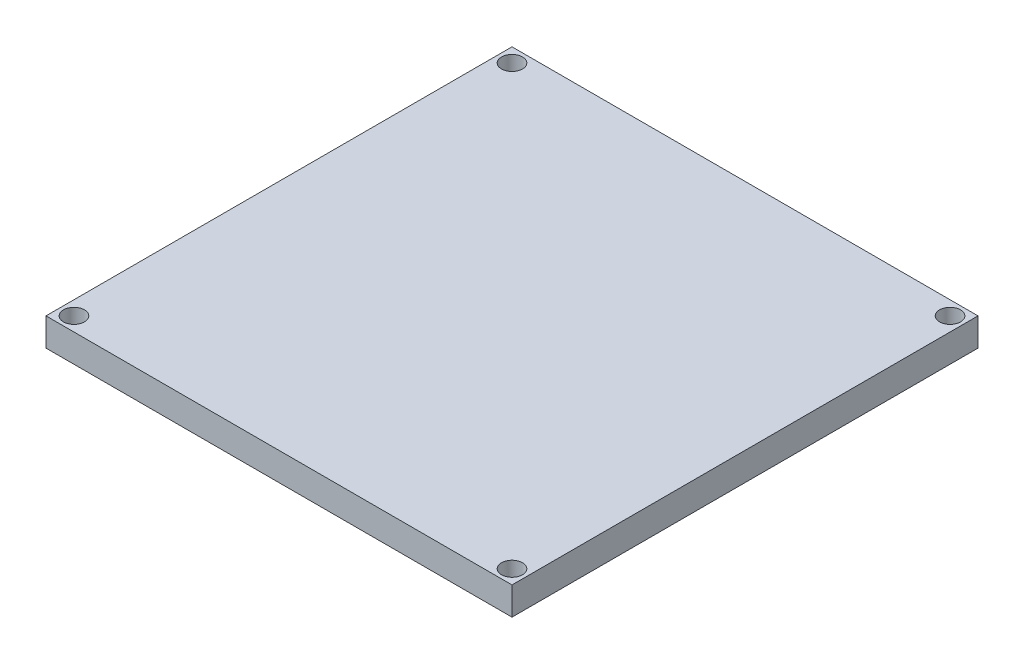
from build123d import *

# Parameters (mm, degrees)
SKETCH1_W           = 100
SKETCH1_H           = 100
BOSS_EXTRUDE1_DEPTH = 6
SKETCH2_R           = 2.25
CUT_EXTRUDE1_DEPTH  = 71.964779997


with BuildPart() as part:
    # Sketch1 → Boss-Extrude1 (new body)
    with BuildSketch(Plane(origin=(0, 0, 0), x_dir=(1, 0, 0), z_dir=(0, 1, 0))):
        Rectangle(SKETCH1_W, SKETCH1_H)
    extrude(amount=BOSS_EXTRUDE1_DEPTH)

    # Sketch2 → Cut-Extrude1 (cut, through all)
    with BuildSketch(Plane(origin=(0, 6, 0), x_dir=(1, 0, 0), z_dir=(0, 1, 0))):
        with Locations(Location((-47, 47, 0), (0, 0, 270))):
            Circle(SKETCH2_R)
        with Locations(Location((47, 47, 0), (0, 0, 270))):
            Circle(SKETCH2_R)
        with Locations(Location((47, -47, 0), (0, 0, 270))):
            Circle(SKETCH2_R)
        with Locations(Location((-47, -47, 0), (0, 0, 270))):
            Circle(SKETCH2_R)
    extrude(amount=-CUT_EXTRUDE1_DEPTH, mode=Mode.SUBTRACT)


solid = part.part
